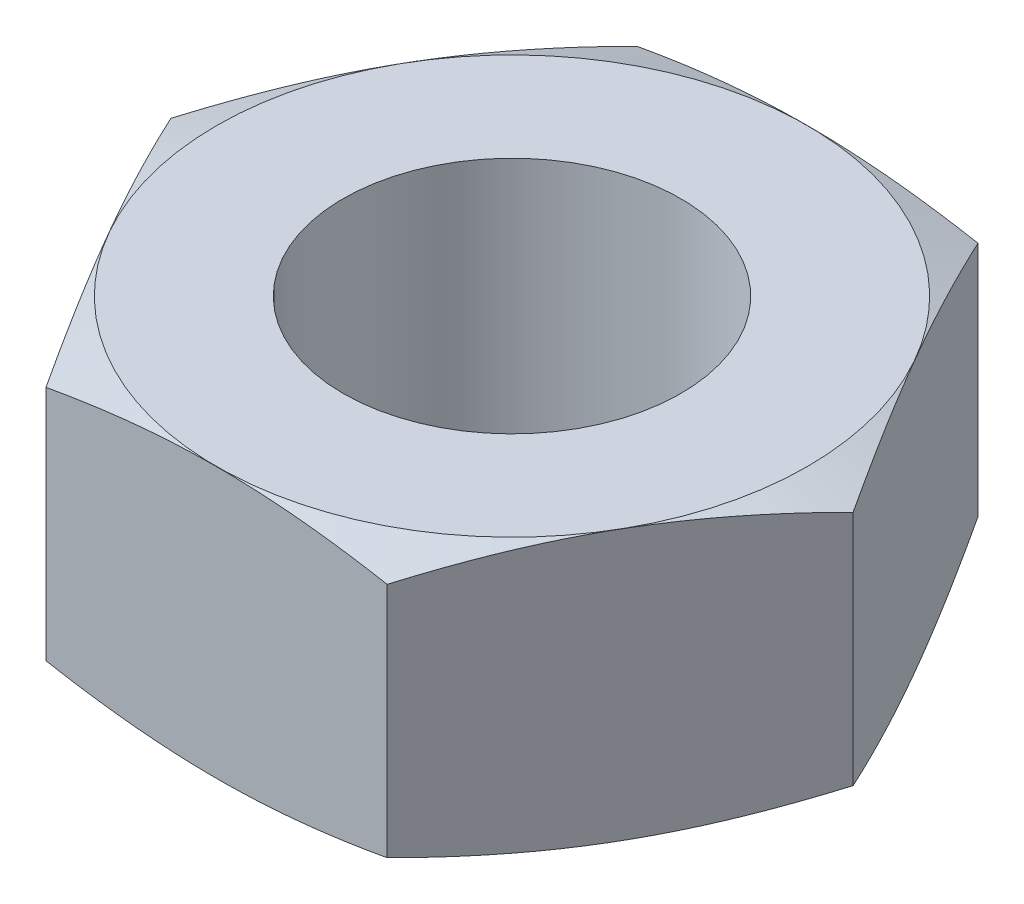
from build123d import *

# Parameters (mm, degrees)
SKETCH2_R           = 2
BOSS_EXTRUDE1_DEPTH = 1.6


with BuildPart() as part:
    # Sketch2 → Boss-Extrude1 (new, symmetric)
    with BuildSketch(Plane(origin=(0, 0, 0), x_dir=(1, 0, 0), z_dir=(0, 1, 0))):
        Polygon((4.041451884, 0), (2.020725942, 3.5), (-2.020725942, 3.5), (-4.041451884, 0), (-2.020725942, -3.5), (2.020725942, -3.5), align=None)
        with Locations(Location((0, 0, 0), (0, 0, 270))):
            Circle(SKETCH2_R, mode=Mode.SUBTRACT)
    extrude(amount=BOSS_EXTRUDE1_DEPTH, both=True)

    # Sketch3 → Cut-Revolve1 (revolve, cut)
    with BuildSketch(Plane.XY, mode=Mode.PRIVATE) as cut_revolve1_sk:
        Polygon((-4.041451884, 1.6), (-3.498951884, 1.6), (-4.041451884, 1.402546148), align=None)
        Polygon((-3.498951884, -1.6), (-4.041451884, -1.402546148), (-4.041451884, -1.6), align=None)
    revolve(cut_revolve1_sk.sketch.rotate(Axis((0, 0, 0), (0, 1, 0)), 180), axis=Axis((0, 0, 0), (0, 1, 0)), mode=Mode.SUBTRACT)


solid = part.part
